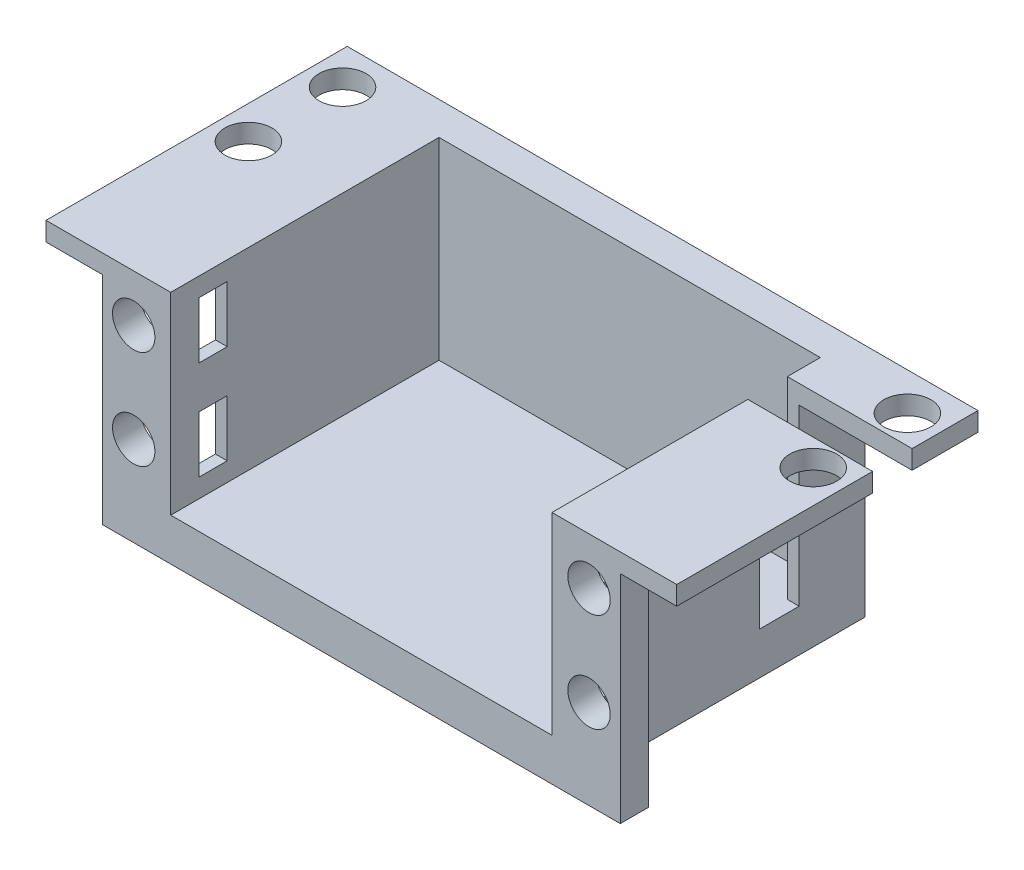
ISO-10303-21;
HEADER;
FILE_DESCRIPTION(('STEP AP214'),'2;1');
FILE_NAME('part.step','',(''),(''),'','','');
FILE_SCHEMA(('AUTOMOTIVE_DESIGN { 1 0 10303 214 1 1 1 1 }'));
ENDSEC;
DATA;
#1=APPLICATION_CONTEXT('core data for automotive mechanical design processes');
#2=APPLICATION_PROTOCOL_DEFINITION('international standard','automotive_design',2000,#1);
#3=PRODUCT_CONTEXT('',#1,'mechanical');
#4=PRODUCT('Part','Part','',(#3));
#5=PRODUCT_RELATED_PRODUCT_CATEGORY('part','',(#4));
#6=PRODUCT_DEFINITION_FORMATION('','',#4);
#7=PRODUCT_DEFINITION_CONTEXT('part definition',#1,'design');
#8=PRODUCT_DEFINITION('design','',#6,#7);
#9=PRODUCT_DEFINITION_SHAPE('','',#8);
#10=(LENGTH_UNIT() NAMED_UNIT(*) SI_UNIT(.MILLI.,.METRE.));
#11=(NAMED_UNIT(*) PLANE_ANGLE_UNIT() SI_UNIT($,.RADIAN.));
#12=(NAMED_UNIT(*) SI_UNIT($,.STERADIAN.) SOLID_ANGLE_UNIT());
#13=UNCERTAINTY_MEASURE_WITH_UNIT(LENGTH_MEASURE(1.E-05),#10,'distance_accuracy_value','');
#14=(GEOMETRIC_REPRESENTATION_CONTEXT(3) GLOBAL_UNCERTAINTY_ASSIGNED_CONTEXT((#13)) GLOBAL_UNIT_ASSIGNED_CONTEXT((#10,
#11,#12)) REPRESENTATION_CONTEXT('',''));
#15=CARTESIAN_POINT('',(0.,0.,0.));
#16=DIRECTION('',(0.,0.,1.));
#17=DIRECTION('',(1.,0.,0.));
#18=AXIS2_PLACEMENT_3D('',#15,#16,#17);
#19=CARTESIAN_POINT('',(0.,25.,0.));
#20=DIRECTION('',(0.,-1.,0.));
#21=DIRECTION('',(0.,0.,-1.));
#22=AXIS2_PLACEMENT_3D('',#19,#20,#21);
#23=PLANE('',#22);
#24=CARTESIAN_POINT('',(57.5,25.,-18.));
#25=DIRECTION('',(0.,1.,0.));
#26=DIRECTION('',(0.,0.,-1.));
#27=AXIS2_PLACEMENT_3D('',#24,#25,#26);
#28=CIRCLE('',#27,2.5);
#29=CARTESIAN_POINT('',(57.5,25.,-20.5));
#30=VERTEX_POINT('',#29);
#31=EDGE_CURVE('E682',#30,#30,#28,.T.);
#32=ORIENTED_EDGE('',*,*,#31,.F.);
#33=EDGE_LOOP('',(#32));
#34=FACE_BOUND('',#33,.T.);
#35=DIRECTION('',(0.,0.,-1.));
#36=VECTOR('',#35,1.);
#37=CARTESIAN_POINT('',(61.,25.,-32.));
#38=LINE('',#37,#36);
#39=CARTESIAN_POINT('',(61.,25.,0.));
#40=VERTEX_POINT('',#39);
#41=CARTESIAN_POINT('',(61.,25.,-20.8));
#42=VERTEX_POINT('',#41);
#43=EDGE_CURVE('E365',#40,#42,#38,.T.);
#44=ORIENTED_EDGE('',*,*,#43,.T.);
#45=DIRECTION('',(-1.,0.,0.));
#46=VECTOR('',#45,1.);
#47=CARTESIAN_POINT('',(0.,25.,-20.8));
#48=LINE('',#47,#46);
#49=CARTESIAN_POINT('',(47.75,25.,-20.8));
#50=VERTEX_POINT('',#49);
#51=EDGE_CURVE('E503',#42,#50,#48,.T.);
#52=ORIENTED_EDGE('',*,*,#51,.T.);
#53=DIRECTION('',(0.,0.,-1.));
#54=VECTOR('',#53,1.);
#55=CARTESIAN_POINT('',(47.75,25.,0.));
#56=LINE('',#55,#54);
#57=CARTESIAN_POINT('',(47.75,25.,0.));
#58=VERTEX_POINT('',#57);
#59=EDGE_CURVE('E326',#58,#50,#56,.T.);
#60=ORIENTED_EDGE('',*,*,#59,.F.);
#61=DIRECTION('',(1.,0.,0.));
#62=VECTOR('',#61,1.);
#63=CARTESIAN_POINT('',(0.,25.,0.));
#64=LINE('',#63,#62);
#65=EDGE_CURVE('E401',#58,#40,#64,.T.);
#66=ORIENTED_EDGE('',*,*,#65,.T.);
#67=EDGE_LOOP('',(#44,#52,#60,#66));
#68=FACE_BOUND('',#67,.T.);
#69=ADVANCED_FACE('F47',(#34,#68),#23,.F.);
#70=CARTESIAN_POINT('',(61.,23.,-32.));
#71=DIRECTION('',(1.,0.,0.));
#72=DIRECTION('',(0.,0.,-1.));
#73=AXIS2_PLACEMENT_3D('',#70,#71,#72);
#74=PLANE('',#73);
#75=DIRECTION('',(0.,1.,0.));
#76=VECTOR('',#75,1.);
#77=CARTESIAN_POINT('',(61.,-9.39973021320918,-20.8));
#78=LINE('',#77,#76);
#79=CARTESIAN_POINT('',(61.,23.,-20.8));
#80=VERTEX_POINT('',#79);
#81=EDGE_CURVE('E722',#80,#42,#78,.T.);
#82=ORIENTED_EDGE('',*,*,#81,.T.);
#83=ORIENTED_EDGE('',*,*,#43,.F.);
#84=DIRECTION('',(0.,1.,0.));
#85=VECTOR('',#84,1.);
#86=CARTESIAN_POINT('',(61.,23.,0.));
#87=LINE('',#86,#85);
#88=CARTESIAN_POINT('',(61.,23.,0.));
#89=VERTEX_POINT('',#88);
#90=EDGE_CURVE('E373',#89,#40,#87,.T.);
#91=ORIENTED_EDGE('',*,*,#90,.F.);
#92=DIRECTION('',(0.,0.,-1.));
#93=VECTOR('',#92,1.);
#94=CARTESIAN_POINT('',(61.,23.,-32.));
#95=LINE('',#94,#93);
#96=EDGE_CURVE('E346',#89,#80,#95,.T.);
#97=ORIENTED_EDGE('',*,*,#96,.T.);
#98=EDGE_LOOP('',(#82,#83,#91,#97));
#99=FACE_BOUND('',#98,.T.);
#100=ADVANCED_FACE('F724',(#99),#74,.T.);
#101=CARTESIAN_POINT('',(0.,23.,0.));
#102=DIRECTION('',(0.,1.,0.));
#103=DIRECTION('',(0.,0.,1.));
#104=AXIS2_PLACEMENT_3D('',#101,#102,#103);
#105=PLANE('',#104);
#106=CARTESIAN_POINT('',(57.5,23.,-18.));
#107=DIRECTION('',(0.,1.,0.));
#108=DIRECTION('',(0.,0.,1.));
#109=AXIS2_PLACEMENT_3D('',#106,#107,#108);
#110=CIRCLE('',#109,2.5);
#111=CARTESIAN_POINT('',(57.5,23.,-15.5));
#112=VERTEX_POINT('',#111);
#113=EDGE_CURVE('E435',#112,#112,#110,.T.);
#114=ORIENTED_EDGE('',*,*,#113,.T.);
#115=EDGE_LOOP('',(#114));
#116=FACE_BOUND('',#115,.T.);
#117=DIRECTION('',(0.,0.,-1.));
#118=VECTOR('',#117,1.);
#119=CARTESIAN_POINT('',(49.,23.,23.7697286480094));
#120=LINE('',#119,#118);
#121=CARTESIAN_POINT('',(49.,23.,-6.));
#122=VERTEX_POINT('',#121);
#123=CARTESIAN_POINT('',(49.,23.,-20.8));
#124=VERTEX_POINT('',#123);
#125=EDGE_CURVE('E628',#122,#124,#120,.T.);
#126=ORIENTED_EDGE('',*,*,#125,.T.);
#127=DIRECTION('',(1.,0.,0.));
#128=VECTOR('',#127,1.);
#129=CARTESIAN_POINT('',(0.,23.,-20.8));
#130=LINE('',#129,#128);
#131=EDGE_CURVE('E495',#124,#80,#130,.T.);
#132=ORIENTED_EDGE('',*,*,#131,.T.);
#133=ORIENTED_EDGE('',*,*,#96,.F.);
#134=DIRECTION('',(1.,0.,0.));
#135=VECTOR('',#134,1.);
#136=CARTESIAN_POINT('',(-6.,23.,0.));
#137=LINE('',#136,#135);
#138=CARTESIAN_POINT('',(55.,23.,0.));
#139=VERTEX_POINT('',#138);
#140=EDGE_CURVE('E359',#139,#89,#137,.T.);
#141=ORIENTED_EDGE('',*,*,#140,.F.);
#142=DIRECTION('',(0.,0.,-1.));
#143=VECTOR('',#142,1.);
#144=CARTESIAN_POINT('',(55.,23.,0.));
#145=LINE('',#144,#143);
#146=CARTESIAN_POINT('',(55.,23.,-3.));
#147=VERTEX_POINT('',#146);
#148=EDGE_CURVE('E377',#139,#147,#145,.T.);
#149=ORIENTED_EDGE('',*,*,#148,.T.);
#150=DIRECTION('',(-1.,0.,0.));
#151=VECTOR('',#150,1.);
#152=CARTESIAN_POINT('',(55.,23.,-3.));
#153=LINE('',#152,#151);
#154=CARTESIAN_POINT('',(47.75,23.,-3.));
#155=VERTEX_POINT('',#154);
#156=EDGE_CURVE('E629',#147,#155,#153,.T.);
#157=ORIENTED_EDGE('',*,*,#156,.T.);
#158=DIRECTION('',(0.,0.,1.));
#159=VECTOR('',#158,1.);
#160=CARTESIAN_POINT('',(47.75,23.,0.));
#161=LINE('',#160,#159);
#162=CARTESIAN_POINT('',(47.75,23.,-6.));
#163=VERTEX_POINT('',#162);
#164=EDGE_CURVE('E563',#163,#155,#161,.T.);
#165=ORIENTED_EDGE('',*,*,#164,.F.);
#166=DIRECTION('',(1.,0.,0.));
#167=VECTOR('',#166,1.);
#168=CARTESIAN_POINT('',(-6.,23.,-6.));
#169=LINE('',#168,#167);
#170=EDGE_CURVE('E507',#163,#122,#169,.T.);
#171=ORIENTED_EDGE('',*,*,#170,.T.);
#172=EDGE_LOOP('',(#126,#132,#133,#141,#149,#157,#165,#171));
#173=FACE_BOUND('',#172,.T.);
#174=ADVANCED_FACE('F734',(#116,#173),#105,.F.);
#175=CARTESIAN_POINT('',(47.75,4.5,0.));
#176=DIRECTION('',(1.,0.,0.));
#177=DIRECTION('',(0.,0.,-1.));
#178=AXIS2_PLACEMENT_3D('',#175,#176,#177);
#179=PLANE('',#178);
#180=ORIENTED_EDGE('',*,*,#164,.T.);
#181=DIRECTION('',(0.,-1.,0.));
#182=VECTOR('',#181,1.);
#183=CARTESIAN_POINT('',(47.75,4.5,-3.));
#184=LINE('',#183,#182);
#185=CARTESIAN_POINT('',(47.75,17.,-3.));
#186=VERTEX_POINT('',#185);
#187=EDGE_CURVE('E571',#155,#186,#184,.T.);
#188=ORIENTED_EDGE('',*,*,#187,.T.);
#189=DIRECTION('',(0.,0.,-1.));
#190=VECTOR('',#189,1.);
#191=CARTESIAN_POINT('',(47.75,17.,0.));
#192=LINE('',#191,#190);
#193=CARTESIAN_POINT('',(47.75,17.,-6.));
#194=VERTEX_POINT('',#193);
#195=EDGE_CURVE('E543',#186,#194,#192,.T.);
#196=ORIENTED_EDGE('',*,*,#195,.T.);
#197=DIRECTION('',(0.,1.,0.));
#198=VECTOR('',#197,1.);
#199=CARTESIAN_POINT('',(47.75,4.5,-6.));
#200=LINE('',#199,#198);
#201=EDGE_CURVE('E555',#194,#163,#200,.T.);
#202=ORIENTED_EDGE('',*,*,#201,.T.);
#203=EDGE_LOOP('',(#180,#188,#196,#202));
#204=FACE_BOUND('',#203,.T.);
#205=DIRECTION('',(0.,0.,1.));
#206=VECTOR('',#205,1.);
#207=CARTESIAN_POINT('',(47.75,12.5,0.));
#208=LINE('',#207,#206);
#209=CARTESIAN_POINT('',(47.75,12.5,-6.));
#210=VERTEX_POINT('',#209);
#211=CARTESIAN_POINT('',(47.75,12.5,-3.));
#212=VERTEX_POINT('',#211);
#213=EDGE_CURVE('E607',#210,#212,#208,.T.);
#214=ORIENTED_EDGE('',*,*,#213,.T.);
#215=DIRECTION('',(0.,-1.,0.));
#216=VECTOR('',#215,1.);
#217=CARTESIAN_POINT('',(47.75,4.5,-3.));
#218=LINE('',#217,#216);
#219=CARTESIAN_POINT('',(47.75,6.5,-3.));
#220=VERTEX_POINT('',#219);
#221=EDGE_CURVE('E615',#212,#220,#218,.T.);
#222=ORIENTED_EDGE('',*,*,#221,.T.);
#223=DIRECTION('',(0.,0.,-1.));
#224=VECTOR('',#223,1.);
#225=CARTESIAN_POINT('',(47.75,6.5,0.));
#226=LINE('',#225,#224);
#227=CARTESIAN_POINT('',(47.75,6.5,-6.));
#228=VERTEX_POINT('',#227);
#229=EDGE_CURVE('E583',#220,#228,#226,.T.);
#230=ORIENTED_EDGE('',*,*,#229,.T.);
#231=DIRECTION('',(0.,1.,0.));
#232=VECTOR('',#231,1.);
#233=CARTESIAN_POINT('',(47.75,4.5,-6.));
#234=LINE('',#233,#232);
#235=EDGE_CURVE('E595',#228,#210,#234,.T.);
#236=ORIENTED_EDGE('',*,*,#235,.T.);
#237=EDGE_LOOP('',(#214,#222,#230,#236));
#238=FACE_BOUND('',#237,.T.);
#239=ORIENTED_EDGE('',*,*,#59,.T.);
#240=DIRECTION('',(0.,1.,0.));
#241=VECTOR('',#240,1.);
#242=CARTESIAN_POINT('',(47.75,-9.39973021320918,-20.8));
#243=LINE('',#242,#241);
#244=CARTESIAN_POINT('',(47.75,4.5,-20.8));
#245=VERTEX_POINT('',#244);
#246=EDGE_CURVE('E299',#245,#50,#243,.T.);
#247=ORIENTED_EDGE('',*,*,#246,.F.);
#248=DIRECTION('',(0.,0.,-1.));
#249=VECTOR('',#248,1.);
#250=CARTESIAN_POINT('',(47.75,4.5,0.));
#251=LINE('',#250,#249);
#252=CARTESIAN_POINT('',(47.75,4.5,0.));
#253=VERTEX_POINT('',#252);
#254=EDGE_CURVE('E306',#253,#245,#251,.T.);
#255=ORIENTED_EDGE('',*,*,#254,.F.);
#256=DIRECTION('',(0.,1.,0.));
#257=VECTOR('',#256,1.);
#258=CARTESIAN_POINT('',(47.75,4.5,0.));
#259=LINE('',#258,#257);
#260=EDGE_CURVE('E340',#253,#58,#259,.T.);
#261=ORIENTED_EDGE('',*,*,#260,.T.);
#262=EDGE_LOOP('',(#239,#247,#255,#261));
#263=FACE_BOUND('',#262,.T.);
#264=ADVANCED_FACE('F715',(#204,#238,#263),#179,.F.);
#265=CARTESIAN_POINT('',(0.,25.,0.));
#266=DIRECTION('',(1.,0.,0.));
#267=DIRECTION('',(0.,0.,-1.));
#268=AXIS2_PLACEMENT_3D('',#265,#266,#267);
#269=PLANE('',#268);
#270=DIRECTION('',(0.,-1.,0.));
#271=VECTOR('',#270,1.);
#272=CARTESIAN_POINT('',(0.,0.,-3.));
#273=LINE('',#272,#271);
#274=CARTESIAN_POINT('',(0.,23.,-3.));
#275=VERTEX_POINT('',#274);
#276=CARTESIAN_POINT('',(0.,0.,-3.));
#277=VERTEX_POINT('',#276);
#278=EDGE_CURVE('E650',#275,#277,#273,.T.);
#279=ORIENTED_EDGE('',*,*,#278,.T.);
#280=DIRECTION('',(0.,0.,1.));
#281=VECTOR('',#280,1.);
#282=CARTESIAN_POINT('',(0.,0.,0.));
#283=LINE('',#282,#281);
#284=CARTESIAN_POINT('',(0.,0.,0.));
#285=VERTEX_POINT('',#284);
#286=EDGE_CURVE('E395',#277,#285,#283,.T.);
#287=ORIENTED_EDGE('',*,*,#286,.T.);
#288=DIRECTION('',(0.,-1.,0.));
#289=VECTOR('',#288,1.);
#290=CARTESIAN_POINT('',(0.,25.,0.));
#291=LINE('',#290,#289);
#292=CARTESIAN_POINT('',(0.,23.,0.));
#293=VERTEX_POINT('',#292);
#294=EDGE_CURVE('E421',#293,#285,#291,.T.);
#295=ORIENTED_EDGE('',*,*,#294,.F.);
#296=DIRECTION('',(0.,0.,1.));
#297=VECTOR('',#296,1.);
#298=CARTESIAN_POINT('',(0.,23.,0.));
#299=LINE('',#298,#297);
#300=EDGE_CURVE('E392',#275,#293,#299,.T.);
#301=ORIENTED_EDGE('',*,*,#300,.F.);
#302=EDGE_LOOP('',(#279,#287,#295,#301));
#303=FACE_BOUND('',#302,.T.);
#304=ADVANCED_FACE('F49',(#303),#269,.F.);
#305=CARTESIAN_POINT('',(55.,25.,0.));
#306=DIRECTION('',(-1.,0.,0.));
#307=DIRECTION('',(0.,0.,1.));
#308=AXIS2_PLACEMENT_3D('',#305,#306,#307);
#309=PLANE('',#308);
#310=DIRECTION('',(0.,1.,0.));
#311=VECTOR('',#310,1.);
#312=CARTESIAN_POINT('',(55.,0.,-3.));
#313=LINE('',#312,#311);
#314=CARTESIAN_POINT('',(55.,0.,-3.));
#315=VERTEX_POINT('',#314);
#316=EDGE_CURVE('E632',#315,#147,#313,.T.);
#317=ORIENTED_EDGE('',*,*,#316,.T.);
#318=ORIENTED_EDGE('',*,*,#148,.F.);
#319=DIRECTION('',(0.,-1.,0.));
#320=VECTOR('',#319,1.);
#321=CARTESIAN_POINT('',(55.,25.,0.));
#322=LINE('',#321,#320);
#323=CARTESIAN_POINT('',(55.,0.,0.));
#324=VERTEX_POINT('',#323);
#325=EDGE_CURVE('E404',#139,#324,#322,.T.);
#326=ORIENTED_EDGE('',*,*,#325,.T.);
#327=DIRECTION('',(0.,0.,-1.));
#328=VECTOR('',#327,1.);
#329=CARTESIAN_POINT('',(55.,0.,0.));
#330=LINE('',#329,#328);
#331=EDGE_CURVE('E411',#324,#315,#330,.T.);
#332=ORIENTED_EDGE('',*,*,#331,.T.);
#333=EDGE_LOOP('',(#317,#318,#326,#332));
#334=FACE_BOUND('',#333,.T.);
#335=ADVANCED_FACE('F761',(#334),#309,.F.);
#336=CARTESIAN_POINT('',(51.6843735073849,20.,-32.));
#337=DIRECTION('',(0.,0.,1.));
#338=DIRECTION('',(1.,0.,0.));
#339=AXIS2_PLACEMENT_3D('',#336,#337,#338);
#340=CYLINDRICAL_SURFACE('',#339,2.25);
#341=CARTESIAN_POINT('',(51.6843735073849,20.,0.));
#342=DIRECTION('',(0.,0.,1.));
#343=DIRECTION('',(1.,0.,0.));
#344=AXIS2_PLACEMENT_3D('',#341,#342,#343);
#345=CIRCLE('',#344,2.25);
#346=CARTESIAN_POINT('',(53.9343735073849,20.,0.));
#347=VERTEX_POINT('',#346);
#348=EDGE_CURVE('E325',#347,#347,#345,.T.);
#349=ORIENTED_EDGE('',*,*,#348,.T.);
#350=EDGE_LOOP('',(#349));
#351=FACE_BOUND('',#350,.T.);
#352=CARTESIAN_POINT('',(51.6843735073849,20.,-3.));
#353=DIRECTION('',(0.,0.,-1.));
#354=DIRECTION('',(-1.,0.,0.));
#355=AXIS2_PLACEMENT_3D('',#352,#353,#354);
#356=CIRCLE('',#355,2.25);
#357=CARTESIAN_POINT('',(49.4343735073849,20.,-3.));
#358=VERTEX_POINT('',#357);
#359=EDGE_CURVE('E448',#358,#358,#356,.F.);
#360=ORIENTED_EDGE('',*,*,#359,.F.);
#361=EDGE_LOOP('',(#360));
#362=FACE_BOUND('',#361,.T.);
#363=ADVANCED_FACE('F905',(#351,#362),#340,.F.);
#364=CARTESIAN_POINT('',(3.31562649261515,9.5,-32.));
#365=DIRECTION('',(0.,0.,1.));
#366=DIRECTION('',(1.,0.,0.));
#367=AXIS2_PLACEMENT_3D('',#364,#365,#366);
#368=CYLINDRICAL_SURFACE('',#367,2.25);
#369=CARTESIAN_POINT('',(3.31562649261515,9.5,0.));
#370=DIRECTION('',(0.,0.,1.));
#371=DIRECTION('',(-1.,0.,0.));
#372=AXIS2_PLACEMENT_3D('',#369,#370,#371);
#373=CIRCLE('',#372,2.25);
#374=CARTESIAN_POINT('',(1.06562649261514,9.5,0.));
#375=VERTEX_POINT('',#374);
#376=EDGE_CURVE('E443',#375,#375,#373,.T.);
#377=ORIENTED_EDGE('',*,*,#376,.T.);
#378=EDGE_LOOP('',(#377));
#379=FACE_BOUND('',#378,.T.);
#380=CARTESIAN_POINT('',(3.31562649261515,9.5,-3.));
#381=DIRECTION('',(0.,0.,-1.));
#382=DIRECTION('',(-1.,0.,0.));
#383=AXIS2_PLACEMENT_3D('',#380,#381,#382);
#384=CIRCLE('',#383,2.25);
#385=CARTESIAN_POINT('',(1.06562649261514,9.5,-3.));
#386=VERTEX_POINT('',#385);
#387=EDGE_CURVE('E454',#386,#386,#384,.F.);
#388=ORIENTED_EDGE('',*,*,#387,.F.);
#389=EDGE_LOOP('',(#388));
#390=FACE_BOUND('',#389,.T.);
#391=ADVANCED_FACE('F901',(#379,#390),#368,.F.);
#392=CARTESIAN_POINT('',(3.31562649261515,20.,-32.));
#393=DIRECTION('',(0.,0.,1.));
#394=DIRECTION('',(1.,0.,0.));
#395=AXIS2_PLACEMENT_3D('',#392,#393,#394);
#396=CYLINDRICAL_SURFACE('',#395,2.25);
#397=CARTESIAN_POINT('',(3.31562649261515,20.,0.));
#398=DIRECTION('',(0.,0.,1.));
#399=DIRECTION('',(-1.,0.,0.));
#400=AXIS2_PLACEMENT_3D('',#397,#398,#399);
#401=CIRCLE('',#400,2.25);
#402=CARTESIAN_POINT('',(1.06562649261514,20.,0.));
#403=VERTEX_POINT('',#402);
#404=EDGE_CURVE('E695',#403,#403,#401,.T.);
#405=ORIENTED_EDGE('',*,*,#404,.T.);
#406=EDGE_LOOP('',(#405));
#407=FACE_BOUND('',#406,.T.);
#408=CARTESIAN_POINT('',(3.31562649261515,20.,-3.));
#409=DIRECTION('',(0.,0.,-1.));
#410=DIRECTION('',(-1.,0.,0.));
#411=AXIS2_PLACEMENT_3D('',#408,#409,#410);
#412=CIRCLE('',#411,2.25);
#413=CARTESIAN_POINT('',(1.06562649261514,20.,-3.));
#414=VERTEX_POINT('',#413);
#415=EDGE_CURVE('E450',#414,#414,#412,.F.);
#416=ORIENTED_EDGE('',*,*,#415,.F.);
#417=EDGE_LOOP('',(#416));
#418=FACE_BOUND('',#417,.T.);
#419=ADVANCED_FACE('F904',(#407,#418),#396,.F.);
#420=CARTESIAN_POINT('',(51.6843735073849,9.5,-32.));
#421=DIRECTION('',(0.,0.,1.));
#422=DIRECTION('',(1.,0.,0.));
#423=AXIS2_PLACEMENT_3D('',#420,#421,#422);
#424=CYLINDRICAL_SURFACE('',#423,2.25);
#425=CARTESIAN_POINT('',(51.6843735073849,9.5,0.));
#426=DIRECTION('',(0.,0.,1.));
#427=DIRECTION('',(1.,0.,0.));
#428=AXIS2_PLACEMENT_3D('',#425,#426,#427);
#429=CIRCLE('',#428,2.25);
#430=CARTESIAN_POINT('',(53.9343735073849,9.5,0.));
#431=VERTEX_POINT('',#430);
#432=EDGE_CURVE('E696',#431,#431,#429,.T.);
#433=ORIENTED_EDGE('',*,*,#432,.T.);
#434=EDGE_LOOP('',(#433));
#435=FACE_BOUND('',#434,.T.);
#436=CARTESIAN_POINT('',(51.6843735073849,9.5,-3.));
#437=DIRECTION('',(0.,0.,-1.));
#438=DIRECTION('',(-1.,0.,0.));
#439=AXIS2_PLACEMENT_3D('',#436,#437,#438);
#440=CIRCLE('',#439,2.25);
#441=CARTESIAN_POINT('',(49.4343735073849,9.5,-3.));
#442=VERTEX_POINT('',#441);
#443=EDGE_CURVE('E444',#442,#442,#440,.F.);
#444=ORIENTED_EDGE('',*,*,#443,.F.);
#445=EDGE_LOOP('',(#444));
#446=FACE_BOUND('',#445,.T.);
#447=ADVANCED_FACE('F907',(#435,#446),#424,.F.);
#448=CARTESIAN_POINT('',(0.,25.,0.));
#449=DIRECTION('',(0.,0.,-1.));
#450=DIRECTION('',(-1.,0.,0.));
#451=AXIS2_PLACEMENT_3D('',#448,#449,#450);
#452=PLANE('',#451);
#453=ORIENTED_EDGE('',*,*,#432,.F.);
#454=EDGE_LOOP('',(#453));
#455=FACE_BOUND('',#454,.T.);
#456=ORIENTED_EDGE('',*,*,#404,.F.);
#457=EDGE_LOOP('',(#456));
#458=FACE_BOUND('',#457,.T.);
#459=ORIENTED_EDGE('',*,*,#376,.F.);
#460=EDGE_LOOP('',(#459));
#461=FACE_BOUND('',#460,.T.);
#462=ORIENTED_EDGE('',*,*,#348,.F.);
#463=EDGE_LOOP('',(#462));
#464=FACE_BOUND('',#463,.T.);
#465=DIRECTION('',(1.,0.,0.));
#466=VECTOR('',#465,1.);
#467=CARTESIAN_POINT('',(7.25,4.5,0.));
#468=LINE('',#467,#466);
#469=CARTESIAN_POINT('',(7.25,4.5,0.));
#470=VERTEX_POINT('',#469);
#471=EDGE_CURVE('E307',#470,#253,#468,.T.);
#472=ORIENTED_EDGE('',*,*,#471,.F.);
#473=DIRECTION('',(0.,1.,0.));
#474=VECTOR('',#473,1.);
#475=CARTESIAN_POINT('',(7.25,4.5,0.));
#476=LINE('',#475,#474);
#477=CARTESIAN_POINT('',(7.25,25.,0.));
#478=VERTEX_POINT('',#477);
#479=EDGE_CURVE('E320',#470,#478,#476,.T.);
#480=ORIENTED_EDGE('',*,*,#479,.T.);
#481=CARTESIAN_POINT('',(-6.,25.,0.));
#482=VERTEX_POINT('',#481);
#483=EDGE_CURVE('E396',#482,#478,#64,.T.);
#484=ORIENTED_EDGE('',*,*,#483,.F.);
#485=DIRECTION('',(0.,1.,0.));
#486=VECTOR('',#485,1.);
#487=CARTESIAN_POINT('',(-6.,23.,0.));
#488=LINE('',#487,#486);
#489=CARTESIAN_POINT('',(-6.,23.,0.));
#490=VERTEX_POINT('',#489);
#491=EDGE_CURVE('E378',#490,#482,#488,.T.);
#492=ORIENTED_EDGE('',*,*,#491,.F.);
#493=EDGE_CURVE('E360',#490,#293,#137,.T.);
#494=ORIENTED_EDGE('',*,*,#493,.T.);
#495=ORIENTED_EDGE('',*,*,#294,.T.);
#496=DIRECTION('',(1.,0.,0.));
#497=VECTOR('',#496,1.);
#498=CARTESIAN_POINT('',(0.,0.,0.));
#499=LINE('',#498,#497);
#500=EDGE_CURVE('E407',#285,#324,#499,.T.);
#501=ORIENTED_EDGE('',*,*,#500,.T.);
#502=ORIENTED_EDGE('',*,*,#325,.F.);
#503=ORIENTED_EDGE('',*,*,#140,.T.);
#504=ORIENTED_EDGE('',*,*,#90,.T.);
#505=ORIENTED_EDGE('',*,*,#65,.F.);
#506=ORIENTED_EDGE('',*,*,#260,.F.);
#507=EDGE_LOOP('',(#472,#480,#484,#492,#494,#495,#501,#502,#503,#504,#505,#506));
#508=FACE_BOUND('',#507,.T.);
#509=ADVANCED_FACE('F711',(#455,#458,#461,#464,#508),#452,.F.);
#510=CARTESIAN_POINT('',(0.,25.,-32.));
#511=DIRECTION('',(0.,0.,1.));
#512=DIRECTION('',(1.,0.,0.));
#513=AXIS2_PLACEMENT_3D('',#510,#511,#512);
#514=PLANE('',#513);
#515=DIRECTION('',(-1.,0.,0.));
#516=VECTOR('',#515,1.);
#517=CARTESIAN_POINT('',(-6.,23.,-32.));
#518=LINE('',#517,#516);
#519=CARTESIAN_POINT('',(61.,23.,-32.));
#520=VERTEX_POINT('',#519);
#521=CARTESIAN_POINT('',(49.,23.,-32.));
#522=VERTEX_POINT('',#521);
#523=EDGE_CURVE('E352',#520,#522,#518,.T.);
#524=ORIENTED_EDGE('',*,*,#523,.T.);
#525=DIRECTION('',(0.,1.,0.));
#526=VECTOR('',#525,1.);
#527=CARTESIAN_POINT('',(49.,0.,-32.));
#528=LINE('',#527,#526);
#529=CARTESIAN_POINT('',(49.,0.,-32.));
#530=VERTEX_POINT('',#529);
#531=EDGE_CURVE('E635',#530,#522,#528,.T.);
#532=ORIENTED_EDGE('',*,*,#531,.F.);
#533=DIRECTION('',(-1.,0.,0.));
#534=VECTOR('',#533,1.);
#535=CARTESIAN_POINT('',(0.,0.,-32.));
#536=LINE('',#535,#534);
#537=CARTESIAN_POINT('',(6.,0.,-32.));
#538=VERTEX_POINT('',#537);
#539=EDGE_CURVE('E415',#530,#538,#536,.T.);
#540=ORIENTED_EDGE('',*,*,#539,.T.);
#541=DIRECTION('',(0.,-1.,0.));
#542=VECTOR('',#541,1.);
#543=CARTESIAN_POINT('',(6.,0.,-32.));
#544=LINE('',#543,#542);
#545=CARTESIAN_POINT('',(6.,23.,-32.));
#546=VERTEX_POINT('',#545);
#547=EDGE_CURVE('E639',#546,#538,#544,.T.);
#548=ORIENTED_EDGE('',*,*,#547,.F.);
#549=CARTESIAN_POINT('',(-6.,23.,-32.));
#550=VERTEX_POINT('',#549);
#551=EDGE_CURVE('E350',#546,#550,#518,.T.);
#552=ORIENTED_EDGE('',*,*,#551,.T.);
#553=DIRECTION('',(0.,1.,0.));
#554=VECTOR('',#553,1.);
#555=CARTESIAN_POINT('',(-6.,23.,-32.));
#556=LINE('',#555,#554);
#557=CARTESIAN_POINT('',(-6.,25.,-32.));
#558=VERTEX_POINT('',#557);
#559=EDGE_CURVE('E382',#550,#558,#556,.T.);
#560=ORIENTED_EDGE('',*,*,#559,.T.);
#561=DIRECTION('',(-1.,0.,0.));
#562=VECTOR('',#561,1.);
#563=CARTESIAN_POINT('',(0.,25.,-32.));
#564=LINE('',#563,#562);
#565=CARTESIAN_POINT('',(61.,25.,-32.));
#566=VERTEX_POINT('',#565);
#567=EDGE_CURVE('E400',#566,#558,#564,.T.);
#568=ORIENTED_EDGE('',*,*,#567,.F.);
#569=DIRECTION('',(0.,1.,0.));
#570=VECTOR('',#569,1.);
#571=CARTESIAN_POINT('',(61.,23.,-32.));
#572=LINE('',#571,#570);
#573=EDGE_CURVE('E364',#520,#566,#572,.T.);
#574=ORIENTED_EDGE('',*,*,#573,.F.);
#575=EDGE_LOOP('',(#524,#532,#540,#548,#552,#560,#568,#574));
#576=FACE_BOUND('',#575,.T.);
#577=ADVANCED_FACE('F777',(#576),#514,.F.);
#578=CARTESIAN_POINT('',(57.5,25.,-28.));
#579=DIRECTION('',(0.,1.,0.));
#580=DIRECTION('',(0.,0.,-1.));
#581=AXIS2_PLACEMENT_3D('',#578,#579,#580);
#582=CIRCLE('',#581,2.5);
#583=CARTESIAN_POINT('',(57.5,25.,-30.5));
#584=VERTEX_POINT('',#583);
#585=EDGE_CURVE('E677',#584,#584,#582,.T.);
#586=ORIENTED_EDGE('',*,*,#585,.F.);
#587=EDGE_LOOP('',(#586));
#588=FACE_BOUND('',#587,.T.);
#589=CARTESIAN_POINT('',(-2.5,25.,-18.));
#590=DIRECTION('',(0.,1.,0.));
#591=DIRECTION('',(0.,0.,1.));
#592=AXIS2_PLACEMENT_3D('',#589,#590,#591);
#593=CIRCLE('',#592,2.5);
#594=CARTESIAN_POINT('',(-2.5,25.,-15.5));
#595=VERTEX_POINT('',#594);
#596=EDGE_CURVE('E678',#595,#595,#593,.T.);
#597=ORIENTED_EDGE('',*,*,#596,.F.);
#598=EDGE_LOOP('',(#597));
#599=FACE_BOUND('',#598,.T.);
#600=CARTESIAN_POINT('',(-2.5,25.,-28.));
#601=DIRECTION('',(0.,1.,0.));
#602=DIRECTION('',(0.,0.,1.));
#603=AXIS2_PLACEMENT_3D('',#600,#601,#602);
#604=CIRCLE('',#603,2.5);
#605=CARTESIAN_POINT('',(-2.5,25.,-25.5));
#606=VERTEX_POINT('',#605);
#607=EDGE_CURVE('E431',#606,#606,#604,.T.);
#608=ORIENTED_EDGE('',*,*,#607,.F.);
#609=EDGE_LOOP('',(#608));
#610=FACE_BOUND('',#609,.T.);
#611=CARTESIAN_POINT('',(47.75,25.,-25.));
#612=VERTEX_POINT('',#611);
#613=CARTESIAN_POINT('',(47.75,25.,-28.5));
#614=VERTEX_POINT('',#613);
#615=EDGE_CURVE('E324',#612,#614,#56,.T.);
#616=ORIENTED_EDGE('',*,*,#615,.F.);
#617=DIRECTION('',(1.,0.,0.));
#618=VECTOR('',#617,1.);
#619=CARTESIAN_POINT('',(0.,25.,-25.));
#620=LINE('',#619,#618);
#621=CARTESIAN_POINT('',(61.,25.,-25.));
#622=VERTEX_POINT('',#621);
#623=EDGE_CURVE('E295',#612,#622,#620,.T.);
#624=ORIENTED_EDGE('',*,*,#623,.T.);
#625=EDGE_CURVE('E337',#622,#566,#38,.T.);
#626=ORIENTED_EDGE('',*,*,#625,.T.);
#627=ORIENTED_EDGE('',*,*,#567,.T.);
#628=DIRECTION('',(0.,0.,1.));
#629=VECTOR('',#628,1.);
#630=CARTESIAN_POINT('',(-6.,25.,-32.));
#631=LINE('',#630,#629);
#632=EDGE_CURVE('E369',#558,#482,#631,.T.);
#633=ORIENTED_EDGE('',*,*,#632,.T.);
#634=ORIENTED_EDGE('',*,*,#483,.T.);
#635=DIRECTION('',(0.,0.,1.));
#636=VECTOR('',#635,1.);
#637=CARTESIAN_POINT('',(7.25,25.,0.));
#638=LINE('',#637,#636);
#639=CARTESIAN_POINT('',(7.25,25.,-28.5));
#640=VERTEX_POINT('',#639);
#641=EDGE_CURVE('E321',#640,#478,#638,.T.);
#642=ORIENTED_EDGE('',*,*,#641,.F.);
#643=DIRECTION('',(-1.,0.,0.));
#644=VECTOR('',#643,1.);
#645=CARTESIAN_POINT('',(7.25,25.,-28.5));
#646=LINE('',#645,#644);
#647=EDGE_CURVE('E330',#614,#640,#646,.T.);
#648=ORIENTED_EDGE('',*,*,#647,.F.);
#649=EDGE_LOOP('',(#616,#624,#626,#627,#633,#634,#642,#648));
#650=FACE_BOUND('',#649,.T.);
#651=ADVANCED_FACE('F824',(#588,#599,#610,#650),#23,.F.);
#652=CARTESIAN_POINT('',(0.,0.,0.));
#653=DIRECTION('',(0.,-1.,0.));
#654=DIRECTION('',(0.,0.,-1.));
#655=AXIS2_PLACEMENT_3D('',#652,#653,#654);
#656=PLANE('',#655);
#657=DIRECTION('',(0.,0.,-1.));
#658=VECTOR('',#657,1.);
#659=CARTESIAN_POINT('',(49.,0.,23.7697286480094));
#660=LINE('',#659,#658);
#661=CARTESIAN_POINT('',(49.,0.,-3.));
#662=VERTEX_POINT('',#661);
#663=EDGE_CURVE('E638',#662,#530,#660,.T.);
#664=ORIENTED_EDGE('',*,*,#663,.F.);
#665=DIRECTION('',(1.,0.,0.));
#666=VECTOR('',#665,1.);
#667=CARTESIAN_POINT('',(55.,0.,-3.));
#668=LINE('',#667,#666);
#669=EDGE_CURVE('E449',#662,#315,#668,.T.);
#670=ORIENTED_EDGE('',*,*,#669,.T.);
#671=ORIENTED_EDGE('',*,*,#331,.F.);
#672=ORIENTED_EDGE('',*,*,#500,.F.);
#673=ORIENTED_EDGE('',*,*,#286,.F.);
#674=DIRECTION('',(1.,0.,0.));
#675=VECTOR('',#674,1.);
#676=CARTESIAN_POINT('',(0.,0.,-3.));
#677=LINE('',#676,#675);
#678=CARTESIAN_POINT('',(6.,0.,-3.));
#679=VERTEX_POINT('',#678);
#680=EDGE_CURVE('E663',#277,#679,#677,.T.);
#681=ORIENTED_EDGE('',*,*,#680,.T.);
#682=DIRECTION('',(0.,0.,-1.));
#683=VECTOR('',#682,1.);
#684=CARTESIAN_POINT('',(6.,0.,23.7697286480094));
#685=LINE('',#684,#683);
#686=EDGE_CURVE('E654',#679,#538,#685,.T.);
#687=ORIENTED_EDGE('',*,*,#686,.T.);
#688=ORIENTED_EDGE('',*,*,#539,.F.);
#689=EDGE_LOOP('',(#664,#670,#671,#672,#673,#681,#687,#688));
#690=FACE_BOUND('',#689,.T.);
#691=ADVANCED_FACE('F758',(#690),#656,.T.);
#692=DIRECTION('',(0.,1.,0.));
#693=VECTOR('',#692,1.);
#694=CARTESIAN_POINT('',(61.,-9.39973021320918,-25.));
#695=LINE('',#694,#693);
#696=CARTESIAN_POINT('',(61.,23.,-25.));
#697=VERTEX_POINT('',#696);
#698=EDGE_CURVE('E290',#697,#622,#695,.T.);
#699=ORIENTED_EDGE('',*,*,#698,.F.);
#700=EDGE_CURVE('E351',#697,#520,#95,.T.);
#701=ORIENTED_EDGE('',*,*,#700,.T.);
#702=ORIENTED_EDGE('',*,*,#573,.T.);
#703=ORIENTED_EDGE('',*,*,#625,.F.);
#704=EDGE_LOOP('',(#699,#701,#702,#703));
#705=FACE_BOUND('',#704,.T.);
#706=ADVANCED_FACE('F832',(#705),#74,.T.);
#707=CARTESIAN_POINT('',(57.5,23.,-28.));
#708=DIRECTION('',(0.,1.,0.));
#709=DIRECTION('',(0.,0.,1.));
#710=AXIS2_PLACEMENT_3D('',#707,#708,#709);
#711=CIRCLE('',#710,2.5);
#712=CARTESIAN_POINT('',(57.5,23.,-25.5));
#713=VERTEX_POINT('',#712);
#714=EDGE_CURVE('E439',#713,#713,#711,.T.);
#715=ORIENTED_EDGE('',*,*,#714,.T.);
#716=EDGE_LOOP('',(#715));
#717=FACE_BOUND('',#716,.T.);
#718=ORIENTED_EDGE('',*,*,#700,.F.);
#719=DIRECTION('',(-1.,0.,0.));
#720=VECTOR('',#719,1.);
#721=CARTESIAN_POINT('',(0.,23.,-25.));
#722=LINE('',#721,#720);
#723=CARTESIAN_POINT('',(49.,23.,-25.));
#724=VERTEX_POINT('',#723);
#725=EDGE_CURVE('E485',#697,#724,#722,.T.);
#726=ORIENTED_EDGE('',*,*,#725,.T.);
#727=EDGE_CURVE('E483',#724,#522,#120,.T.);
#728=ORIENTED_EDGE('',*,*,#727,.T.);
#729=ORIENTED_EDGE('',*,*,#523,.F.);
#730=EDGE_LOOP('',(#718,#726,#728,#729));
#731=FACE_BOUND('',#730,.T.);
#732=ADVANCED_FACE('F489',(#717,#731),#105,.F.);
#733=CARTESIAN_POINT('',(-2.5,23.,-28.));
#734=DIRECTION('',(0.,1.,0.));
#735=DIRECTION('',(0.,0.,1.));
#736=AXIS2_PLACEMENT_3D('',#733,#734,#735);
#737=CIRCLE('',#736,2.5);
#738=CARTESIAN_POINT('',(-2.5,23.,-25.5));
#739=VERTEX_POINT('',#738);
#740=EDGE_CURVE('E426',#739,#739,#737,.T.);
#741=ORIENTED_EDGE('',*,*,#740,.T.);
#742=EDGE_LOOP('',(#741));
#743=FACE_BOUND('',#742,.T.);
#744=CARTESIAN_POINT('',(-2.5,23.,-18.));
#745=DIRECTION('',(0.,1.,0.));
#746=DIRECTION('',(0.,0.,1.));
#747=AXIS2_PLACEMENT_3D('',#744,#745,#746);
#748=CIRCLE('',#747,2.5);
#749=CARTESIAN_POINT('',(-2.5,23.,-15.5));
#750=VERTEX_POINT('',#749);
#751=EDGE_CURVE('E430',#750,#750,#748,.T.);
#752=ORIENTED_EDGE('',*,*,#751,.T.);
#753=EDGE_LOOP('',(#752));
#754=FACE_BOUND('',#753,.T.);
#755=DIRECTION('',(0.,0.,-1.));
#756=VECTOR('',#755,1.);
#757=CARTESIAN_POINT('',(6.,23.,23.7697286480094));
#758=LINE('',#757,#756);
#759=CARTESIAN_POINT('',(6.,23.,-6.));
#760=VERTEX_POINT('',#759);
#761=EDGE_CURVE('E651',#760,#546,#758,.T.);
#762=ORIENTED_EDGE('',*,*,#761,.F.);
#763=CARTESIAN_POINT('',(7.25,23.,-6.));
#764=VERTEX_POINT('',#763);
#765=EDGE_CURVE('E535',#760,#764,#169,.T.);
#766=ORIENTED_EDGE('',*,*,#765,.T.);
#767=DIRECTION('',(0.,0.,-1.));
#768=VECTOR('',#767,1.);
#769=CARTESIAN_POINT('',(7.25,23.,0.));
#770=LINE('',#769,#768);
#771=CARTESIAN_POINT('',(7.25,23.,-3.));
#772=VERTEX_POINT('',#771);
#773=EDGE_CURVE('E567',#772,#764,#770,.T.);
#774=ORIENTED_EDGE('',*,*,#773,.F.);
#775=DIRECTION('',(-1.,0.,0.));
#776=VECTOR('',#775,1.);
#777=CARTESIAN_POINT('',(0.,23.,-3.));
#778=LINE('',#777,#776);
#779=EDGE_CURVE('E623',#772,#275,#778,.T.);
#780=ORIENTED_EDGE('',*,*,#779,.T.);
#781=ORIENTED_EDGE('',*,*,#300,.T.);
#782=ORIENTED_EDGE('',*,*,#493,.F.);
#783=DIRECTION('',(0.,0.,1.));
#784=VECTOR('',#783,1.);
#785=CARTESIAN_POINT('',(-6.,23.,-32.));
#786=LINE('',#785,#784);
#787=EDGE_CURVE('E356',#550,#490,#786,.T.);
#788=ORIENTED_EDGE('',*,*,#787,.F.);
#789=ORIENTED_EDGE('',*,*,#551,.F.);
#790=EDGE_LOOP('',(#762,#766,#774,#780,#781,#782,#788,#789));
#791=FACE_BOUND('',#790,.T.);
#792=ADVANCED_FACE('F807',(#743,#754,#791),#105,.F.);
#793=CARTESIAN_POINT('',(-6.,23.,-32.));
#794=DIRECTION('',(-1.,0.,0.));
#795=DIRECTION('',(0.,0.,1.));
#796=AXIS2_PLACEMENT_3D('',#793,#794,#795);
#797=PLANE('',#796);
#798=ORIENTED_EDGE('',*,*,#632,.F.);
#799=ORIENTED_EDGE('',*,*,#559,.F.);
#800=ORIENTED_EDGE('',*,*,#787,.T.);
#801=ORIENTED_EDGE('',*,*,#491,.T.);
#802=EDGE_LOOP('',(#798,#799,#800,#801));
#803=FACE_BOUND('',#802,.T.);
#804=ADVANCED_FACE('F821',(#803),#797,.T.);
#805=CARTESIAN_POINT('',(7.25,4.5,0.));
#806=DIRECTION('',(-1.,0.,0.));
#807=DIRECTION('',(0.,0.,1.));
#808=AXIS2_PLACEMENT_3D('',#805,#806,#807);
#809=PLANE('',#808);
#810=DIRECTION('',(0.,0.,1.));
#811=VECTOR('',#810,1.);
#812=CARTESIAN_POINT('',(7.25,6.5,0.));
#813=LINE('',#812,#811);
#814=CARTESIAN_POINT('',(7.25,6.5,-6.));
#815=VERTEX_POINT('',#814);
#816=CARTESIAN_POINT('',(7.25,6.5,-3.));
#817=VERTEX_POINT('',#816);
#818=EDGE_CURVE('E587',#815,#817,#813,.T.);
#819=ORIENTED_EDGE('',*,*,#818,.T.);
#820=DIRECTION('',(0.,1.,0.));
#821=VECTOR('',#820,1.);
#822=CARTESIAN_POINT('',(7.25,4.5,-3.));
#823=LINE('',#822,#821);
#824=CARTESIAN_POINT('',(7.25,12.5,-3.));
#825=VERTEX_POINT('',#824);
#826=EDGE_CURVE('E619',#817,#825,#823,.T.);
#827=ORIENTED_EDGE('',*,*,#826,.T.);
#828=DIRECTION('',(0.,0.,-1.));
#829=VECTOR('',#828,1.);
#830=CARTESIAN_POINT('',(7.25,12.5,0.));
#831=LINE('',#830,#829);
#832=CARTESIAN_POINT('',(7.25,12.5,-6.));
#833=VERTEX_POINT('',#832);
#834=EDGE_CURVE('E611',#825,#833,#831,.T.);
#835=ORIENTED_EDGE('',*,*,#834,.T.);
#836=DIRECTION('',(0.,-1.,0.));
#837=VECTOR('',#836,1.);
#838=CARTESIAN_POINT('',(7.25,4.5,-6.));
#839=LINE('',#838,#837);
#840=EDGE_CURVE('E599',#833,#815,#839,.T.);
#841=ORIENTED_EDGE('',*,*,#840,.T.);
#842=EDGE_LOOP('',(#819,#827,#835,#841));
#843=FACE_BOUND('',#842,.T.);
#844=DIRECTION('',(0.,0.,1.));
#845=VECTOR('',#844,1.);
#846=CARTESIAN_POINT('',(7.25,17.,0.));
#847=LINE('',#846,#845);
#848=CARTESIAN_POINT('',(7.25,17.,-6.));
#849=VERTEX_POINT('',#848);
#850=CARTESIAN_POINT('',(7.25,17.,-3.));
#851=VERTEX_POINT('',#850);
#852=EDGE_CURVE('E547',#849,#851,#847,.T.);
#853=ORIENTED_EDGE('',*,*,#852,.T.);
#854=DIRECTION('',(0.,1.,0.));
#855=VECTOR('',#854,1.);
#856=CARTESIAN_POINT('',(7.25,4.5,-3.));
#857=LINE('',#856,#855);
#858=EDGE_CURVE('E575',#851,#772,#857,.T.);
#859=ORIENTED_EDGE('',*,*,#858,.T.);
#860=ORIENTED_EDGE('',*,*,#773,.T.);
#861=DIRECTION('',(0.,-1.,0.));
#862=VECTOR('',#861,1.);
#863=CARTESIAN_POINT('',(7.25,4.5,-6.));
#864=LINE('',#863,#862);
#865=EDGE_CURVE('E559',#764,#849,#864,.T.);
#866=ORIENTED_EDGE('',*,*,#865,.T.);
#867=EDGE_LOOP('',(#853,#859,#860,#866));
#868=FACE_BOUND('',#867,.T.);
#869=ORIENTED_EDGE('',*,*,#641,.T.);
#870=ORIENTED_EDGE('',*,*,#479,.F.);
#871=DIRECTION('',(0.,0.,1.));
#872=VECTOR('',#871,1.);
#873=CARTESIAN_POINT('',(7.25,4.5,0.));
#874=LINE('',#873,#872);
#875=CARTESIAN_POINT('',(7.25,4.5,-28.5));
#876=VERTEX_POINT('',#875);
#877=EDGE_CURVE('E314',#876,#470,#874,.T.);
#878=ORIENTED_EDGE('',*,*,#877,.F.);
#879=DIRECTION('',(0.,1.,0.));
#880=VECTOR('',#879,1.);
#881=CARTESIAN_POINT('',(7.25,4.5,-28.5));
#882=LINE('',#881,#880);
#883=EDGE_CURVE('E334',#876,#640,#882,.T.);
#884=ORIENTED_EDGE('',*,*,#883,.T.);
#885=EDGE_LOOP('',(#869,#870,#878,#884));
#886=FACE_BOUND('',#885,.T.);
#887=ADVANCED_FACE('F812',(#843,#868,#886),#809,.F.);
#888=CARTESIAN_POINT('',(7.25,4.5,-28.5));
#889=DIRECTION('',(0.,0.,-1.));
#890=DIRECTION('',(-1.,0.,0.));
#891=AXIS2_PLACEMENT_3D('',#888,#889,#890);
#892=PLANE('',#891);
#893=ORIENTED_EDGE('',*,*,#647,.T.);
#894=ORIENTED_EDGE('',*,*,#883,.F.);
#895=DIRECTION('',(-1.,0.,0.));
#896=VECTOR('',#895,1.);
#897=CARTESIAN_POINT('',(7.25,4.5,-28.5));
#898=LINE('',#897,#896);
#899=CARTESIAN_POINT('',(47.75,4.5,-28.5));
#900=VERTEX_POINT('',#899);
#901=EDGE_CURVE('E312',#900,#876,#898,.T.);
#902=ORIENTED_EDGE('',*,*,#901,.F.);
#903=DIRECTION('',(0.,1.,0.));
#904=VECTOR('',#903,1.);
#905=CARTESIAN_POINT('',(47.75,4.5,-28.5));
#906=LINE('',#905,#904);
#907=EDGE_CURVE('E303',#900,#614,#906,.T.);
#908=ORIENTED_EDGE('',*,*,#907,.T.);
#909=EDGE_LOOP('',(#893,#894,#902,#908));
#910=FACE_BOUND('',#909,.T.);
#911=ADVANCED_FACE('F836',(#910),#892,.F.);
#912=CARTESIAN_POINT('',(47.75,4.5,-25.));
#913=VERTEX_POINT('',#912);
#914=EDGE_CURVE('E283',#913,#900,#251,.T.);
#915=ORIENTED_EDGE('',*,*,#914,.F.);
#916=DIRECTION('',(0.,1.,0.));
#917=VECTOR('',#916,1.);
#918=CARTESIAN_POINT('',(47.75,-9.39973021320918,-25.));
#919=LINE('',#918,#917);
#920=EDGE_CURVE('E289',#913,#612,#919,.T.);
#921=ORIENTED_EDGE('',*,*,#920,.T.);
#922=ORIENTED_EDGE('',*,*,#615,.T.);
#923=ORIENTED_EDGE('',*,*,#907,.F.);
#924=EDGE_LOOP('',(#915,#921,#922,#923));
#925=FACE_BOUND('',#924,.T.);
#926=ADVANCED_FACE('F301',(#925),#179,.F.);
#927=CARTESIAN_POINT('',(0.,4.5,0.));
#928=DIRECTION('',(0.,-1.,0.));
#929=DIRECTION('',(0.,0.,-1.));
#930=AXIS2_PLACEMENT_3D('',#927,#928,#929);
#931=PLANE('',#930);
#932=ORIENTED_EDGE('',*,*,#877,.T.);
#933=ORIENTED_EDGE('',*,*,#471,.T.);
#934=ORIENTED_EDGE('',*,*,#254,.T.);
#935=DIRECTION('',(1.,0.,0.));
#936=VECTOR('',#935,1.);
#937=CARTESIAN_POINT('',(47.75,4.5,-20.8));
#938=LINE('',#937,#936);
#939=CARTESIAN_POINT('',(49.,4.5,-20.8));
#940=VERTEX_POINT('',#939);
#941=EDGE_CURVE('E728',#245,#940,#938,.T.);
#942=ORIENTED_EDGE('',*,*,#941,.T.);
#943=DIRECTION('',(0.,0.,1.));
#944=VECTOR('',#943,1.);
#945=CARTESIAN_POINT('',(49.,4.5,23.7697286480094));
#946=LINE('',#945,#944);
#947=CARTESIAN_POINT('',(49.,4.5,-25.));
#948=VERTEX_POINT('',#947);
#949=EDGE_CURVE('E56',#948,#940,#946,.T.);
#950=ORIENTED_EDGE('',*,*,#949,.F.);
#951=DIRECTION('',(-1.,0.,0.));
#952=VECTOR('',#951,1.);
#953=CARTESIAN_POINT('',(47.75,4.5,-25.));
#954=LINE('',#953,#952);
#955=EDGE_CURVE('E63',#948,#913,#954,.T.);
#956=ORIENTED_EDGE('',*,*,#955,.T.);
#957=ORIENTED_EDGE('',*,*,#914,.T.);
#958=ORIENTED_EDGE('',*,*,#901,.T.);
#959=EDGE_LOOP('',(#932,#933,#934,#942,#950,#956,#957,#958));
#960=FACE_BOUND('',#959,.T.);
#961=ADVANCED_FACE('F280',(#960),#931,.F.);
#962=CARTESIAN_POINT('',(-2.5,0.,-28.));
#963=DIRECTION('',(0.,1.,0.));
#964=DIRECTION('',(0.,0.,1.));
#965=AXIS2_PLACEMENT_3D('',#962,#963,#964);
#966=CYLINDRICAL_SURFACE('',#965,2.5);
#967=ORIENTED_EDGE('',*,*,#607,.T.);
#968=EDGE_LOOP('',(#967));
#969=FACE_BOUND('',#968,.T.);
#970=ORIENTED_EDGE('',*,*,#740,.F.);
#971=EDGE_LOOP('',(#970));
#972=FACE_BOUND('',#971,.T.);
#973=ADVANCED_FACE('F874',(#969,#972),#966,.F.);
#974=CARTESIAN_POINT('',(-2.5,0.,-18.));
#975=DIRECTION('',(0.,1.,0.));
#976=DIRECTION('',(0.,0.,1.));
#977=AXIS2_PLACEMENT_3D('',#974,#975,#976);
#978=CYLINDRICAL_SURFACE('',#977,2.5);
#979=ORIENTED_EDGE('',*,*,#596,.T.);
#980=EDGE_LOOP('',(#979));
#981=FACE_BOUND('',#980,.T.);
#982=ORIENTED_EDGE('',*,*,#751,.F.);
#983=EDGE_LOOP('',(#982));
#984=FACE_BOUND('',#983,.T.);
#985=ADVANCED_FACE('F877',(#981,#984),#978,.F.);
#986=CARTESIAN_POINT('',(57.5,0.,-18.));
#987=DIRECTION('',(0.,1.,0.));
#988=DIRECTION('',(0.,0.,1.));
#989=AXIS2_PLACEMENT_3D('',#986,#987,#988);
#990=CYLINDRICAL_SURFACE('',#989,2.5);
#991=ORIENTED_EDGE('',*,*,#31,.T.);
#992=EDGE_LOOP('',(#991));
#993=FACE_BOUND('',#992,.T.);
#994=ORIENTED_EDGE('',*,*,#113,.F.);
#995=EDGE_LOOP('',(#994));
#996=FACE_BOUND('',#995,.T.);
#997=ADVANCED_FACE('F886',(#993,#996),#990,.F.);
#998=CARTESIAN_POINT('',(57.5,0.,-28.));
#999=DIRECTION('',(0.,1.,0.));
#1000=DIRECTION('',(0.,0.,1.));
#1001=AXIS2_PLACEMENT_3D('',#998,#999,#1000);
#1002=CYLINDRICAL_SURFACE('',#1001,2.5);
#1003=ORIENTED_EDGE('',*,*,#585,.T.);
#1004=EDGE_LOOP('',(#1003));
#1005=FACE_BOUND('',#1004,.T.);
#1006=ORIENTED_EDGE('',*,*,#714,.F.);
#1007=EDGE_LOOP('',(#1006));
#1008=FACE_BOUND('',#1007,.T.);
#1009=ADVANCED_FACE('F892',(#1005,#1008),#1002,.F.);
#1010=CARTESIAN_POINT('',(0.,25.,-3.));
#1011=DIRECTION('',(0.,0.,-1.));
#1012=DIRECTION('',(-1.,0.,0.));
#1013=AXIS2_PLACEMENT_3D('',#1010,#1011,#1012);
#1014=PLANE('',#1013);
#1015=DIRECTION('',(0.,-1.,0.));
#1016=VECTOR('',#1015,1.);
#1017=CARTESIAN_POINT('',(49.,0.,-3.));
#1018=LINE('',#1017,#1016);
#1019=CARTESIAN_POINT('',(49.,6.5,-3.));
#1020=VERTEX_POINT('',#1019);
#1021=EDGE_CURVE('E624',#1020,#662,#1018,.T.);
#1022=ORIENTED_EDGE('',*,*,#1021,.F.);
#1023=DIRECTION('',(1.,0.,0.));
#1024=VECTOR('',#1023,1.);
#1025=CARTESIAN_POINT('',(-6.,6.5,-3.));
#1026=LINE('',#1025,#1024);
#1027=EDGE_CURVE('E523',#220,#1020,#1026,.T.);
#1028=ORIENTED_EDGE('',*,*,#1027,.F.);
#1029=ORIENTED_EDGE('',*,*,#221,.F.);
#1030=DIRECTION('',(1.,0.,0.));
#1031=VECTOR('',#1030,1.);
#1032=CARTESIAN_POINT('',(-6.,12.5,-3.));
#1033=LINE('',#1032,#1031);
#1034=CARTESIAN_POINT('',(49.,12.5,-3.));
#1035=VERTEX_POINT('',#1034);
#1036=EDGE_CURVE('E508',#212,#1035,#1033,.T.);
#1037=ORIENTED_EDGE('',*,*,#1036,.T.);
#1038=CARTESIAN_POINT('',(49.,17.,-3.));
#1039=VERTEX_POINT('',#1038);
#1040=EDGE_CURVE('E627',#1039,#1035,#1018,.T.);
#1041=ORIENTED_EDGE('',*,*,#1040,.F.);
#1042=DIRECTION('',(1.,0.,0.));
#1043=VECTOR('',#1042,1.);
#1044=CARTESIAN_POINT('',(-6.,17.,-3.));
#1045=LINE('',#1044,#1043);
#1046=EDGE_CURVE('E527',#186,#1039,#1045,.T.);
#1047=ORIENTED_EDGE('',*,*,#1046,.F.);
#1048=ORIENTED_EDGE('',*,*,#187,.F.);
#1049=ORIENTED_EDGE('',*,*,#156,.F.);
#1050=ORIENTED_EDGE('',*,*,#316,.F.);
#1051=ORIENTED_EDGE('',*,*,#669,.F.);
#1052=EDGE_LOOP('',(#1022,#1028,#1029,#1037,#1041,#1047,#1048,#1049,#1050,#1051));
#1053=FACE_BOUND('',#1052,.T.);
#1054=ORIENTED_EDGE('',*,*,#443,.T.);
#1055=EDGE_LOOP('',(#1054));
#1056=FACE_BOUND('',#1055,.T.);
#1057=ORIENTED_EDGE('',*,*,#359,.T.);
#1058=EDGE_LOOP('',(#1057));
#1059=FACE_BOUND('',#1058,.T.);
#1060=ADVANCED_FACE('F747',(#1053,#1056,#1059),#1014,.T.);
#1061=CARTESIAN_POINT('',(49.,0.,23.7697286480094));
#1062=DIRECTION('',(-1.,0.,0.));
#1063=DIRECTION('',(0.,0.,1.));
#1064=AXIS2_PLACEMENT_3D('',#1061,#1062,#1063);
#1065=PLANE('',#1064);
#1066=ORIENTED_EDGE('',*,*,#949,.T.);
#1067=DIRECTION('',(0.,1.,0.));
#1068=VECTOR('',#1067,1.);
#1069=CARTESIAN_POINT('',(49.,0.,-20.8));
#1070=LINE('',#1069,#1068);
#1071=EDGE_CURVE('E12',#940,#124,#1070,.T.);
#1072=ORIENTED_EDGE('',*,*,#1071,.T.);
#1073=ORIENTED_EDGE('',*,*,#125,.F.);
#1074=DIRECTION('',(0.,-1.,0.));
#1075=VECTOR('',#1074,1.);
#1076=CARTESIAN_POINT('',(49.,0.,-6.));
#1077=LINE('',#1076,#1075);
#1078=CARTESIAN_POINT('',(49.,17.,-6.));
#1079=VERTEX_POINT('',#1078);
#1080=EDGE_CURVE('E551',#122,#1079,#1077,.T.);
#1081=ORIENTED_EDGE('',*,*,#1080,.T.);
#1082=DIRECTION('',(0.,0.,1.));
#1083=VECTOR('',#1082,1.);
#1084=CARTESIAN_POINT('',(49.,17.,23.7697286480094));
#1085=LINE('',#1084,#1083);
#1086=EDGE_CURVE('E539',#1079,#1039,#1085,.T.);
#1087=ORIENTED_EDGE('',*,*,#1086,.T.);
#1088=ORIENTED_EDGE('',*,*,#1040,.T.);
#1089=DIRECTION('',(0.,0.,-1.));
#1090=VECTOR('',#1089,1.);
#1091=CARTESIAN_POINT('',(49.,12.5,23.7697286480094));
#1092=LINE('',#1091,#1090);
#1093=CARTESIAN_POINT('',(49.,12.5,-6.));
#1094=VERTEX_POINT('',#1093);
#1095=EDGE_CURVE('E603',#1035,#1094,#1092,.T.);
#1096=ORIENTED_EDGE('',*,*,#1095,.T.);
#1097=DIRECTION('',(0.,-1.,0.));
#1098=VECTOR('',#1097,1.);
#1099=CARTESIAN_POINT('',(49.,0.,-6.));
#1100=LINE('',#1099,#1098);
#1101=CARTESIAN_POINT('',(49.,6.5,-6.));
#1102=VERTEX_POINT('',#1101);
#1103=EDGE_CURVE('E591',#1094,#1102,#1100,.T.);
#1104=ORIENTED_EDGE('',*,*,#1103,.T.);
#1105=DIRECTION('',(0.,0.,1.));
#1106=VECTOR('',#1105,1.);
#1107=CARTESIAN_POINT('',(49.,6.5,23.7697286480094));
#1108=LINE('',#1107,#1106);
#1109=EDGE_CURVE('E579',#1102,#1020,#1108,.T.);
#1110=ORIENTED_EDGE('',*,*,#1109,.T.);
#1111=ORIENTED_EDGE('',*,*,#1021,.T.);
#1112=ORIENTED_EDGE('',*,*,#663,.T.);
#1113=ORIENTED_EDGE('',*,*,#531,.T.);
#1114=ORIENTED_EDGE('',*,*,#727,.F.);
#1115=DIRECTION('',(0.,-1.,0.));
#1116=VECTOR('',#1115,1.);
#1117=CARTESIAN_POINT('',(49.,0.,-25.));
#1118=LINE('',#1117,#1116);
#1119=EDGE_CURVE('E474',#724,#948,#1118,.T.);
#1120=ORIENTED_EDGE('',*,*,#1119,.T.);
#1121=EDGE_LOOP('',(#1066,#1072,#1073,#1081,#1087,#1088,#1096,#1104,#1110,#1111,#1112,#1113,
#1114,#1120));
#1122=FACE_BOUND('',#1121,.T.);
#1123=ADVANCED_FACE('F478',(#1122),#1065,.F.);
#1124=CARTESIAN_POINT('',(0.,25.,-3.));
#1125=DIRECTION('',(0.,0.,-1.));
#1126=DIRECTION('',(-1.,0.,0.));
#1127=AXIS2_PLACEMENT_3D('',#1124,#1125,#1126);
#1128=PLANE('',#1127);
#1129=ORIENTED_EDGE('',*,*,#680,.F.);
#1130=ORIENTED_EDGE('',*,*,#278,.F.);
#1131=ORIENTED_EDGE('',*,*,#779,.F.);
#1132=ORIENTED_EDGE('',*,*,#858,.F.);
#1133=CARTESIAN_POINT('',(6.,17.,-3.));
#1134=VERTEX_POINT('',#1133);
#1135=EDGE_CURVE('E526',#1134,#851,#1045,.T.);
#1136=ORIENTED_EDGE('',*,*,#1135,.F.);
#1137=DIRECTION('',(0.,1.,0.));
#1138=VECTOR('',#1137,1.);
#1139=CARTESIAN_POINT('',(6.,0.,-3.));
#1140=LINE('',#1139,#1138);
#1141=CARTESIAN_POINT('',(6.,12.5,-3.));
#1142=VERTEX_POINT('',#1141);
#1143=EDGE_CURVE('E667',#1142,#1134,#1140,.T.);
#1144=ORIENTED_EDGE('',*,*,#1143,.F.);
#1145=EDGE_CURVE('E512',#1142,#825,#1033,.T.);
#1146=ORIENTED_EDGE('',*,*,#1145,.T.);
#1147=ORIENTED_EDGE('',*,*,#826,.F.);
#1148=CARTESIAN_POINT('',(6.,6.5,-3.));
#1149=VERTEX_POINT('',#1148);
#1150=EDGE_CURVE('E71',#1149,#817,#1026,.T.);
#1151=ORIENTED_EDGE('',*,*,#1150,.F.);
#1152=EDGE_CURVE('E658',#679,#1149,#1140,.T.);
#1153=ORIENTED_EDGE('',*,*,#1152,.F.);
#1154=EDGE_LOOP('',(#1129,#1130,#1131,#1132,#1136,#1144,#1146,#1147,#1151,#1153));
#1155=FACE_BOUND('',#1154,.T.);
#1156=ORIENTED_EDGE('',*,*,#387,.T.);
#1157=EDGE_LOOP('',(#1156));
#1158=FACE_BOUND('',#1157,.T.);
#1159=ORIENTED_EDGE('',*,*,#415,.T.);
#1160=EDGE_LOOP('',(#1159));
#1161=FACE_BOUND('',#1160,.T.);
#1162=ADVANCED_FACE('F769',(#1155,#1158,#1161),#1128,.T.);
#1163=CARTESIAN_POINT('',(6.,0.,23.7697286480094));
#1164=DIRECTION('',(1.,0.,0.));
#1165=DIRECTION('',(0.,0.,-1.));
#1166=AXIS2_PLACEMENT_3D('',#1163,#1164,#1165);
#1167=PLANE('',#1166);
#1168=DIRECTION('',(0.,1.,0.));
#1169=VECTOR('',#1168,1.);
#1170=CARTESIAN_POINT('',(6.,0.,-6.));
#1171=LINE('',#1170,#1169);
#1172=CARTESIAN_POINT('',(6.,6.5,-6.));
#1173=VERTEX_POINT('',#1172);
#1174=CARTESIAN_POINT('',(6.,12.5,-6.));
#1175=VERTEX_POINT('',#1174);
#1176=EDGE_CURVE('E466',#1173,#1175,#1171,.T.);
#1177=ORIENTED_EDGE('',*,*,#1176,.T.);
#1178=DIRECTION('',(0.,0.,1.));
#1179=VECTOR('',#1178,1.);
#1180=CARTESIAN_POINT('',(6.,12.5,23.7697286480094));
#1181=LINE('',#1180,#1179);
#1182=EDGE_CURVE('E470',#1175,#1142,#1181,.T.);
#1183=ORIENTED_EDGE('',*,*,#1182,.T.);
#1184=ORIENTED_EDGE('',*,*,#1143,.T.);
#1185=DIRECTION('',(0.,0.,-1.));
#1186=VECTOR('',#1185,1.);
#1187=CARTESIAN_POINT('',(6.,17.,23.7697286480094));
#1188=LINE('',#1187,#1186);
#1189=CARTESIAN_POINT('',(6.,17.,-6.));
#1190=VERTEX_POINT('',#1189);
#1191=EDGE_CURVE('E425',#1134,#1190,#1188,.T.);
#1192=ORIENTED_EDGE('',*,*,#1191,.T.);
#1193=DIRECTION('',(0.,1.,0.));
#1194=VECTOR('',#1193,1.);
#1195=CARTESIAN_POINT('',(6.,0.,-6.));
#1196=LINE('',#1195,#1194);
#1197=EDGE_CURVE('E458',#1190,#760,#1196,.T.);
#1198=ORIENTED_EDGE('',*,*,#1197,.T.);
#1199=ORIENTED_EDGE('',*,*,#761,.T.);
#1200=ORIENTED_EDGE('',*,*,#547,.T.);
#1201=ORIENTED_EDGE('',*,*,#686,.F.);
#1202=ORIENTED_EDGE('',*,*,#1152,.T.);
#1203=DIRECTION('',(0.,0.,-1.));
#1204=VECTOR('',#1203,1.);
#1205=CARTESIAN_POINT('',(6.,6.5,23.7697286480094));
#1206=LINE('',#1205,#1204);
#1207=EDGE_CURVE('E462',#1149,#1173,#1206,.T.);
#1208=ORIENTED_EDGE('',*,*,#1207,.T.);
#1209=EDGE_LOOP('',(#1177,#1183,#1184,#1192,#1198,#1199,#1200,#1201,#1202,#1208));
#1210=FACE_BOUND('',#1209,.T.);
#1211=ADVANCED_FACE('F773',(#1210),#1167,.F.);
#1212=CARTESIAN_POINT('',(-6.,17.,-3.));
#1213=DIRECTION('',(0.,-1.,0.));
#1214=DIRECTION('',(0.,0.,-1.));
#1215=AXIS2_PLACEMENT_3D('',#1212,#1213,#1214);
#1216=PLANE('',#1215);
#1217=DIRECTION('',(1.,0.,0.));
#1218=VECTOR('',#1217,1.);
#1219=CARTESIAN_POINT('',(-6.,17.,-6.));
#1220=LINE('',#1219,#1218);
#1221=EDGE_CURVE('E530',#1190,#849,#1220,.T.);
#1222=ORIENTED_EDGE('',*,*,#1221,.F.);
#1223=ORIENTED_EDGE('',*,*,#1191,.F.);
#1224=ORIENTED_EDGE('',*,*,#1135,.T.);
#1225=ORIENTED_EDGE('',*,*,#852,.F.);
#1226=EDGE_LOOP('',(#1222,#1223,#1224,#1225));
#1227=FACE_BOUND('',#1226,.T.);
#1228=ADVANCED_FACE('F1075',(#1227),#1216,.F.);
#1229=CARTESIAN_POINT('',(-6.,23.,-6.));
#1230=DIRECTION('',(0.,0.,-1.));
#1231=DIRECTION('',(0.,1.,0.));
#1232=AXIS2_PLACEMENT_3D('',#1229,#1230,#1231);
#1233=PLANE('',#1232);
#1234=ORIENTED_EDGE('',*,*,#765,.F.);
#1235=ORIENTED_EDGE('',*,*,#1197,.F.);
#1236=ORIENTED_EDGE('',*,*,#1221,.T.);
#1237=ORIENTED_EDGE('',*,*,#865,.F.);
#1238=EDGE_LOOP('',(#1234,#1235,#1236,#1237));
#1239=FACE_BOUND('',#1238,.T.);
#1240=ADVANCED_FACE('F1082',(#1239),#1233,.F.);
#1241=CARTESIAN_POINT('',(-6.,6.5,-3.));
#1242=DIRECTION('',(0.,-1.,0.));
#1243=DIRECTION('',(0.,0.,-1.));
#1244=AXIS2_PLACEMENT_3D('',#1241,#1242,#1243);
#1245=PLANE('',#1244);
#1246=DIRECTION('',(1.,0.,0.));
#1247=VECTOR('',#1246,1.);
#1248=CARTESIAN_POINT('',(-6.,6.5,-6.));
#1249=LINE('',#1248,#1247);
#1250=EDGE_CURVE('E518',#1173,#815,#1249,.T.);
#1251=ORIENTED_EDGE('',*,*,#1250,.F.);
#1252=ORIENTED_EDGE('',*,*,#1207,.F.);
#1253=ORIENTED_EDGE('',*,*,#1150,.T.);
#1254=ORIENTED_EDGE('',*,*,#818,.F.);
#1255=EDGE_LOOP('',(#1251,#1252,#1253,#1254));
#1256=FACE_BOUND('',#1255,.T.);
#1257=ADVANCED_FACE('F1092',(#1256),#1245,.F.);
#1258=CARTESIAN_POINT('',(-6.,12.5,-6.));
#1259=DIRECTION('',(0.,0.,-1.));
#1260=DIRECTION('',(0.,1.,0.));
#1261=AXIS2_PLACEMENT_3D('',#1258,#1259,#1260);
#1262=PLANE('',#1261);
#1263=DIRECTION('',(1.,0.,0.));
#1264=VECTOR('',#1263,1.);
#1265=CARTESIAN_POINT('',(-6.,12.5,-6.));
#1266=LINE('',#1265,#1264);
#1267=EDGE_CURVE('E513',#1175,#833,#1266,.T.);
#1268=ORIENTED_EDGE('',*,*,#1267,.F.);
#1269=ORIENTED_EDGE('',*,*,#1176,.F.);
#1270=ORIENTED_EDGE('',*,*,#1250,.T.);
#1271=ORIENTED_EDGE('',*,*,#840,.F.);
#1272=EDGE_LOOP('',(#1268,#1269,#1270,#1271));
#1273=FACE_BOUND('',#1272,.T.);
#1274=ADVANCED_FACE('F1100',(#1273),#1262,.F.);
#1275=CARTESIAN_POINT('',(-6.,12.5,-3.));
#1276=DIRECTION('',(0.,1.,0.));
#1277=DIRECTION('',(0.,0.,1.));
#1278=AXIS2_PLACEMENT_3D('',#1275,#1276,#1277);
#1279=PLANE('',#1278);
#1280=ORIENTED_EDGE('',*,*,#1145,.F.);
#1281=ORIENTED_EDGE('',*,*,#1182,.F.);
#1282=ORIENTED_EDGE('',*,*,#1267,.T.);
#1283=ORIENTED_EDGE('',*,*,#834,.F.);
#1284=EDGE_LOOP('',(#1280,#1281,#1282,#1283));
#1285=FACE_BOUND('',#1284,.T.);
#1286=ADVANCED_FACE('F1109',(#1285),#1279,.F.);
#1287=EDGE_CURVE('E531',#194,#1079,#1220,.T.);
#1288=ORIENTED_EDGE('',*,*,#1287,.T.);
#1289=ORIENTED_EDGE('',*,*,#1080,.F.);
#1290=ORIENTED_EDGE('',*,*,#170,.F.);
#1291=ORIENTED_EDGE('',*,*,#201,.F.);
#1292=EDGE_LOOP('',(#1288,#1289,#1290,#1291));
#1293=FACE_BOUND('',#1292,.T.);
#1294=ADVANCED_FACE('F739',(#1293),#1233,.F.);
#1295=ORIENTED_EDGE('',*,*,#1046,.T.);
#1296=ORIENTED_EDGE('',*,*,#1086,.F.);
#1297=ORIENTED_EDGE('',*,*,#1287,.F.);
#1298=ORIENTED_EDGE('',*,*,#195,.F.);
#1299=EDGE_LOOP('',(#1295,#1296,#1297,#1298));
#1300=FACE_BOUND('',#1299,.T.);
#1301=ADVANCED_FACE('F742',(#1300),#1216,.F.);
#1302=EDGE_CURVE('E514',#210,#1094,#1266,.T.);
#1303=ORIENTED_EDGE('',*,*,#1302,.T.);
#1304=ORIENTED_EDGE('',*,*,#1095,.F.);
#1305=ORIENTED_EDGE('',*,*,#1036,.F.);
#1306=ORIENTED_EDGE('',*,*,#213,.F.);
#1307=EDGE_LOOP('',(#1303,#1304,#1305,#1306));
#1308=FACE_BOUND('',#1307,.T.);
#1309=ADVANCED_FACE('F785',(#1308),#1279,.F.);
#1310=EDGE_CURVE('E519',#228,#1102,#1249,.T.);
#1311=ORIENTED_EDGE('',*,*,#1310,.T.);
#1312=ORIENTED_EDGE('',*,*,#1103,.F.);
#1313=ORIENTED_EDGE('',*,*,#1302,.F.);
#1314=ORIENTED_EDGE('',*,*,#235,.F.);
#1315=EDGE_LOOP('',(#1311,#1312,#1313,#1314));
#1316=FACE_BOUND('',#1315,.T.);
#1317=ADVANCED_FACE('F787',(#1316),#1262,.F.);
#1318=ORIENTED_EDGE('',*,*,#1027,.T.);
#1319=ORIENTED_EDGE('',*,*,#1109,.F.);
#1320=ORIENTED_EDGE('',*,*,#1310,.F.);
#1321=ORIENTED_EDGE('',*,*,#229,.F.);
#1322=EDGE_LOOP('',(#1318,#1319,#1320,#1321));
#1323=FACE_BOUND('',#1322,.T.);
#1324=ADVANCED_FACE('F1102',(#1323),#1245,.F.);
#1325=CARTESIAN_POINT('',(47.75,-9.39973021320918,-20.8));
#1326=DIRECTION('',(0.,0.,1.));
#1327=DIRECTION('',(1.,0.,0.));
#1328=AXIS2_PLACEMENT_3D('',#1325,#1326,#1327);
#1329=PLANE('',#1328);
#1330=ORIENTED_EDGE('',*,*,#81,.F.);
#1331=ORIENTED_EDGE('',*,*,#131,.F.);
#1332=ORIENTED_EDGE('',*,*,#1071,.F.);
#1333=ORIENTED_EDGE('',*,*,#941,.F.);
#1334=ORIENTED_EDGE('',*,*,#246,.T.);
#1335=ORIENTED_EDGE('',*,*,#51,.F.);
#1336=EDGE_LOOP('',(#1330,#1331,#1332,#1333,#1334,#1335));
#1337=FACE_BOUND('',#1336,.T.);
#1338=ADVANCED_FACE('F721',(#1337),#1329,.F.);
#1339=CARTESIAN_POINT('',(47.75,-9.39973021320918,-25.));
#1340=DIRECTION('',(0.,0.,-1.));
#1341=DIRECTION('',(-1.,0.,0.));
#1342=AXIS2_PLACEMENT_3D('',#1339,#1340,#1341);
#1343=PLANE('',#1342);
#1344=ORIENTED_EDGE('',*,*,#920,.F.);
#1345=ORIENTED_EDGE('',*,*,#955,.F.);
#1346=ORIENTED_EDGE('',*,*,#1119,.F.);
#1347=ORIENTED_EDGE('',*,*,#725,.F.);
#1348=ORIENTED_EDGE('',*,*,#698,.T.);
#1349=ORIENTED_EDGE('',*,*,#623,.F.);
#1350=EDGE_LOOP('',(#1344,#1345,#1346,#1347,#1348,#1349));
#1351=FACE_BOUND('',#1350,.T.);
#1352=ADVANCED_FACE('F293',(#1351),#1343,.F.);
#1353=CLOSED_SHELL('',(#69,#100,#174,#264,#304,#335,#363,#391,#419,#447,#509,#577,#651,#691,
#706,#732,#792,#804,#887,#911,#926,#961,#973,#985,#997,#1009,#1060,#1123,#1162,#1211,#1228,
#1240,#1257,#1274,#1286,#1294,#1301,#1309,#1317,#1324,#1338,#1352));
#1354=MANIFOLD_SOLID_BREP('B2',#1353);
#1355=ADVANCED_BREP_SHAPE_REPRESENTATION('',(#18,#1354),#14);
#1356=SHAPE_DEFINITION_REPRESENTATION(#9,#1355);
ENDSEC;
END-ISO-10303-21;
